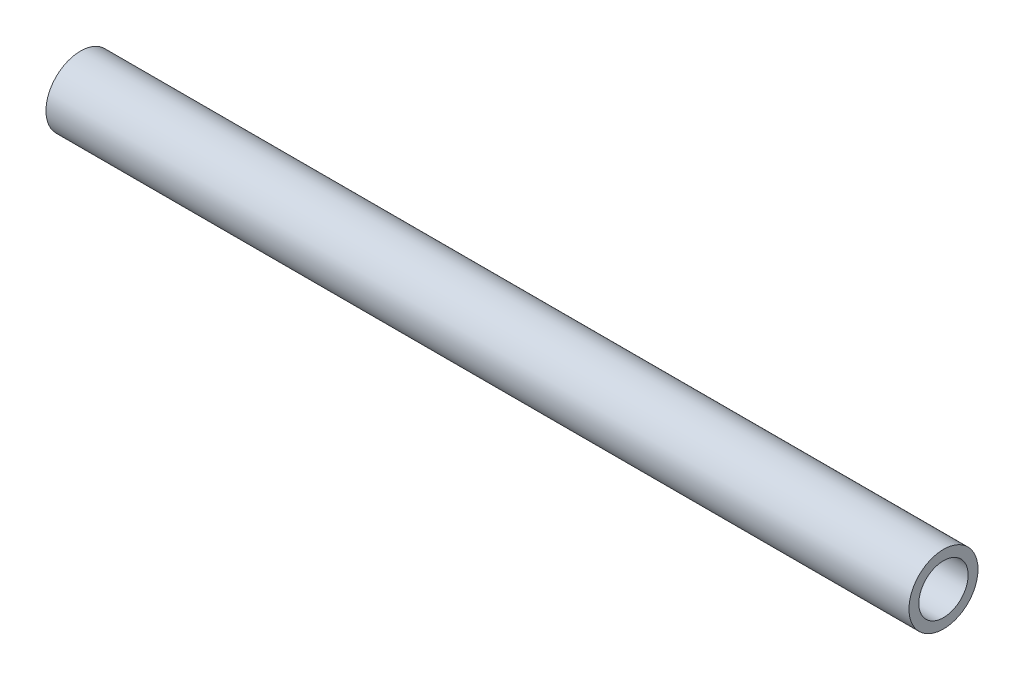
ISO-10303-21;
HEADER;
FILE_DESCRIPTION(('STEP AP214'),'2;1');
FILE_NAME('part.step','',(''),(''),'','','');
FILE_SCHEMA(('AUTOMOTIVE_DESIGN { 1 0 10303 214 1 1 1 1 }'));
ENDSEC;
DATA;
#1=APPLICATION_CONTEXT('core data for automotive mechanical design processes');
#2=APPLICATION_PROTOCOL_DEFINITION('international standard','automotive_design',2000,#1);
#3=PRODUCT_CONTEXT('',#1,'mechanical');
#4=PRODUCT('Part','Part','',(#3));
#5=PRODUCT_RELATED_PRODUCT_CATEGORY('part','',(#4));
#6=PRODUCT_DEFINITION_FORMATION('','',#4);
#7=PRODUCT_DEFINITION_CONTEXT('part definition',#1,'design');
#8=PRODUCT_DEFINITION('design','',#6,#7);
#9=PRODUCT_DEFINITION_SHAPE('','',#8);
#10=(LENGTH_UNIT() NAMED_UNIT(*) SI_UNIT(.MILLI.,.METRE.));
#11=(NAMED_UNIT(*) PLANE_ANGLE_UNIT() SI_UNIT($,.RADIAN.));
#12=(NAMED_UNIT(*) SI_UNIT($,.STERADIAN.) SOLID_ANGLE_UNIT());
#13=UNCERTAINTY_MEASURE_WITH_UNIT(LENGTH_MEASURE(1.E-05),#10,'distance_accuracy_value','');
#14=(GEOMETRIC_REPRESENTATION_CONTEXT(3) GLOBAL_UNCERTAINTY_ASSIGNED_CONTEXT((#13)) GLOBAL_UNIT_ASSIGNED_CONTEXT((#10,
#11,#12)) REPRESENTATION_CONTEXT('',''));
#15=CARTESIAN_POINT('',(0.,0.,0.));
#16=DIRECTION('',(0.,0.,1.));
#17=DIRECTION('',(1.,0.,0.));
#18=AXIS2_PLACEMENT_3D('',#15,#16,#17);
#19=CARTESIAN_POINT('',(266.7,0.,0.));
#20=DIRECTION('',(-1.,0.,0.));
#21=DIRECTION('',(0.,0.,1.));
#22=AXIS2_PLACEMENT_3D('',#19,#20,#21);
#23=CYLINDRICAL_SURFACE('',#22,7.62);
#24=CARTESIAN_POINT('',(266.7,0.,0.));
#25=DIRECTION('',(1.,0.,0.));
#26=DIRECTION('',(0.,0.,-1.));
#27=AXIS2_PLACEMENT_3D('',#24,#25,#26);
#28=CIRCLE('',#27,7.62);
#29=CARTESIAN_POINT('',(266.7,0.,-7.62));
#30=VERTEX_POINT('',#29);
#31=EDGE_CURVE('E53',#30,#30,#28,.T.);
#32=ORIENTED_EDGE('',*,*,#31,.T.);
#33=EDGE_LOOP('',(#32));
#34=FACE_BOUND('',#33,.T.);
#35=CARTESIAN_POINT('',(0.,0.,0.));
#36=DIRECTION('',(1.,0.,0.));
#37=DIRECTION('',(0.,0.,-1.));
#38=AXIS2_PLACEMENT_3D('',#35,#36,#37);
#39=CIRCLE('',#38,7.62);
#40=CARTESIAN_POINT('',(0.,0.,-7.62));
#41=VERTEX_POINT('',#40);
#42=EDGE_CURVE('E60',#41,#41,#39,.T.);
#43=ORIENTED_EDGE('',*,*,#42,.F.);
#44=EDGE_LOOP('',(#43));
#45=FACE_BOUND('',#44,.T.);
#46=ADVANCED_FACE('F45',(#34,#45),#23,.F.);
#47=CARTESIAN_POINT('',(266.7,0.,0.));
#48=DIRECTION('',(-1.,0.,0.));
#49=DIRECTION('',(0.,0.,1.));
#50=AXIS2_PLACEMENT_3D('',#47,#48,#49);
#51=CYLINDRICAL_SURFACE('',#50,10.668);
#52=CARTESIAN_POINT('',(266.7,0.,0.));
#53=DIRECTION('',(1.,0.,0.));
#54=DIRECTION('',(0.,0.,-1.));
#55=AXIS2_PLACEMENT_3D('',#52,#53,#54);
#56=CIRCLE('',#55,10.668);
#57=CARTESIAN_POINT('',(266.7,0.,-10.668));
#58=VERTEX_POINT('',#57);
#59=EDGE_CURVE('E10',#58,#58,#56,.T.);
#60=ORIENTED_EDGE('',*,*,#59,.F.);
#61=EDGE_LOOP('',(#60));
#62=FACE_BOUND('',#61,.T.);
#63=CARTESIAN_POINT('',(0.,0.,0.));
#64=DIRECTION('',(1.,0.,0.));
#65=DIRECTION('',(0.,0.,-1.));
#66=AXIS2_PLACEMENT_3D('',#63,#64,#65);
#67=CIRCLE('',#66,10.668);
#68=CARTESIAN_POINT('',(0.,0.,-10.668));
#69=VERTEX_POINT('',#68);
#70=EDGE_CURVE('E48',#69,#69,#67,.T.);
#71=ORIENTED_EDGE('',*,*,#70,.T.);
#72=EDGE_LOOP('',(#71));
#73=FACE_BOUND('',#72,.T.);
#74=ADVANCED_FACE('F69',(#62,#73),#51,.T.);
#75=CARTESIAN_POINT('',(266.7,0.,0.));
#76=DIRECTION('',(1.,0.,0.));
#77=DIRECTION('',(0.,0.,-1.));
#78=AXIS2_PLACEMENT_3D('',#75,#76,#77);
#79=PLANE('',#78);
#80=ORIENTED_EDGE('',*,*,#31,.F.);
#81=EDGE_LOOP('',(#80));
#82=FACE_BOUND('',#81,.T.);
#83=ORIENTED_EDGE('',*,*,#59,.T.);
#84=EDGE_LOOP('',(#83));
#85=FACE_BOUND('',#84,.T.);
#86=ADVANCED_FACE('F73',(#82,#85),#79,.T.);
#87=CARTESIAN_POINT('',(0.,0.,0.));
#88=DIRECTION('',(1.,0.,0.));
#89=DIRECTION('',(0.,0.,-1.));
#90=AXIS2_PLACEMENT_3D('',#87,#88,#89);
#91=PLANE('',#90);
#92=ORIENTED_EDGE('',*,*,#42,.T.);
#93=EDGE_LOOP('',(#92));
#94=FACE_BOUND('',#93,.T.);
#95=ORIENTED_EDGE('',*,*,#70,.F.);
#96=EDGE_LOOP('',(#95));
#97=FACE_BOUND('',#96,.T.);
#98=ADVANCED_FACE('F71',(#94,#97),#91,.F.);
#99=CLOSED_SHELL('',(#46,#74,#86,#98));
#100=MANIFOLD_SOLID_BREP('B2',#99);
#101=ADVANCED_BREP_SHAPE_REPRESENTATION('',(#18,#100),#14);
#102=SHAPE_DEFINITION_REPRESENTATION(#9,#101);
ENDSEC;
END-ISO-10303-21;
